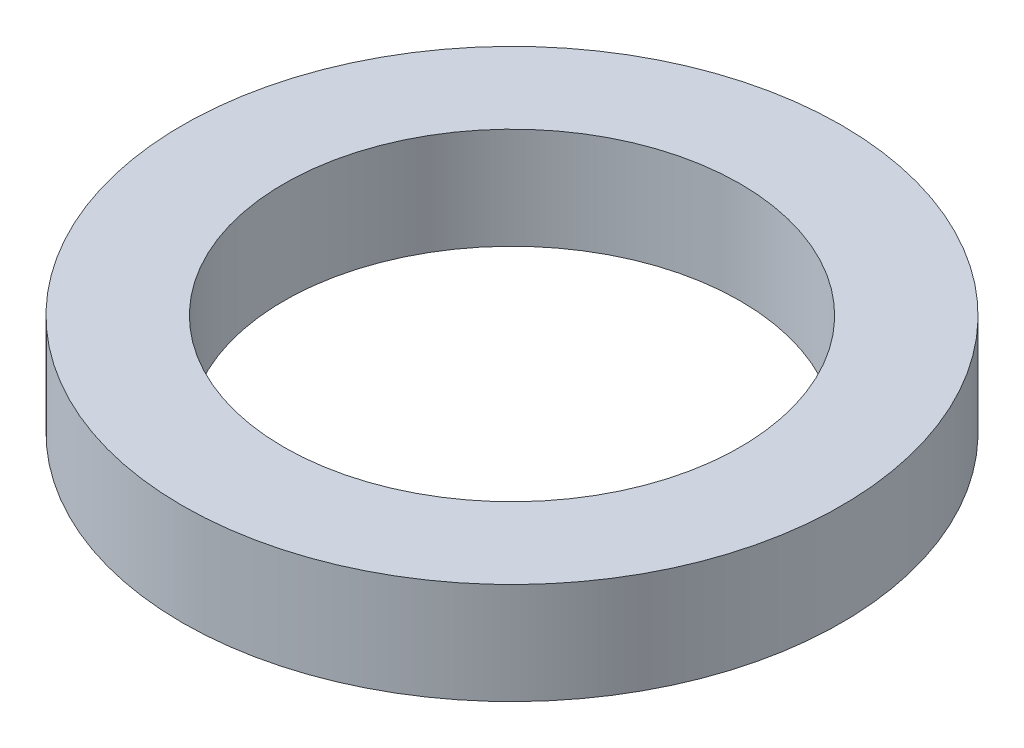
ISO-10303-21;
HEADER;
FILE_DESCRIPTION(('STEP AP214'),'2;1');
FILE_NAME('part.step','',(''),(''),'','','');
FILE_SCHEMA(('AUTOMOTIVE_DESIGN { 1 0 10303 214 1 1 1 1 }'));
ENDSEC;
DATA;
#1=APPLICATION_CONTEXT('core data for automotive mechanical design processes');
#2=APPLICATION_PROTOCOL_DEFINITION('international standard','automotive_design',2000,#1);
#3=PRODUCT_CONTEXT('',#1,'mechanical');
#4=PRODUCT('Part','Part','',(#3));
#5=PRODUCT_RELATED_PRODUCT_CATEGORY('part','',(#4));
#6=PRODUCT_DEFINITION_FORMATION('','',#4);
#7=PRODUCT_DEFINITION_CONTEXT('part definition',#1,'design');
#8=PRODUCT_DEFINITION('design','',#6,#7);
#9=PRODUCT_DEFINITION_SHAPE('','',#8);
#10=(LENGTH_UNIT() NAMED_UNIT(*) SI_UNIT(.MILLI.,.METRE.));
#11=(NAMED_UNIT(*) PLANE_ANGLE_UNIT() SI_UNIT($,.RADIAN.));
#12=(NAMED_UNIT(*) SI_UNIT($,.STERADIAN.) SOLID_ANGLE_UNIT());
#13=UNCERTAINTY_MEASURE_WITH_UNIT(LENGTH_MEASURE(1.E-05),#10,'distance_accuracy_value','');
#14=(GEOMETRIC_REPRESENTATION_CONTEXT(3) GLOBAL_UNCERTAINTY_ASSIGNED_CONTEXT((#13)) GLOBAL_UNIT_ASSIGNED_CONTEXT((#10,
#11,#12)) REPRESENTATION_CONTEXT('',''));
#15=CARTESIAN_POINT('',(0.,0.,0.));
#16=DIRECTION('',(0.,0.,1.));
#17=DIRECTION('',(1.,0.,0.));
#18=AXIS2_PLACEMENT_3D('',#15,#16,#17);
#19=CARTESIAN_POINT('',(0.,1.,0.));
#20=DIRECTION('',(0.,1.,0.));
#21=DIRECTION('',(0.,0.,1.));
#22=AXIS2_PLACEMENT_3D('',#19,#20,#21);
#23=PLANE('',#22);
#24=CARTESIAN_POINT('',(0.,1.,0.));
#25=DIRECTION('',(0.,1.,0.));
#26=DIRECTION('',(0.,0.,1.));
#27=AXIS2_PLACEMENT_3D('',#24,#25,#26);
#28=CIRCLE('',#27,3.25);
#29=CARTESIAN_POINT('',(0.,1.,3.25));
#30=VERTEX_POINT('',#29);
#31=EDGE_CURVE('E10',#30,#30,#28,.T.);
#32=ORIENTED_EDGE('',*,*,#31,.T.);
#33=EDGE_LOOP('',(#32));
#34=FACE_BOUND('',#33,.T.);
#35=CARTESIAN_POINT('',(0.,1.,0.));
#36=DIRECTION('',(0.,1.,0.));
#37=DIRECTION('',(0.,0.,1.));
#38=AXIS2_PLACEMENT_3D('',#35,#36,#37);
#39=CIRCLE('',#38,2.25);
#40=CARTESIAN_POINT('',(0.,1.,2.25));
#41=VERTEX_POINT('',#40);
#42=EDGE_CURVE('E42',#41,#41,#39,.T.);
#43=ORIENTED_EDGE('',*,*,#42,.F.);
#44=EDGE_LOOP('',(#43));
#45=FACE_BOUND('',#44,.T.);
#46=ADVANCED_FACE('F31',(#34,#45),#23,.T.);
#47=CARTESIAN_POINT('',(0.,0.,0.));
#48=DIRECTION('',(0.,1.,0.));
#49=DIRECTION('',(0.,0.,1.));
#50=AXIS2_PLACEMENT_3D('',#47,#48,#49);
#51=PLANE('',#50);
#52=CARTESIAN_POINT('',(0.,0.,0.));
#53=DIRECTION('',(0.,1.,0.));
#54=DIRECTION('',(0.,0.,1.));
#55=AXIS2_PLACEMENT_3D('',#52,#53,#54);
#56=CIRCLE('',#55,3.25);
#57=CARTESIAN_POINT('',(0.,0.,3.25));
#58=VERTEX_POINT('',#57);
#59=EDGE_CURVE('E35',#58,#58,#56,.T.);
#60=ORIENTED_EDGE('',*,*,#59,.F.);
#61=EDGE_LOOP('',(#60));
#62=FACE_BOUND('',#61,.T.);
#63=CARTESIAN_POINT('',(0.,0.,0.));
#64=DIRECTION('',(0.,1.,0.));
#65=DIRECTION('',(0.,0.,1.));
#66=AXIS2_PLACEMENT_3D('',#63,#64,#65);
#67=CIRCLE('',#66,2.25);
#68=CARTESIAN_POINT('',(0.,0.,2.25));
#69=VERTEX_POINT('',#68);
#70=EDGE_CURVE('E44',#69,#69,#67,.T.);
#71=ORIENTED_EDGE('',*,*,#70,.T.);
#72=EDGE_LOOP('',(#71));
#73=FACE_BOUND('',#72,.T.);
#74=ADVANCED_FACE('F54',(#62,#73),#51,.F.);
#75=CARTESIAN_POINT('',(0.,1.,0.));
#76=DIRECTION('',(0.,-1.,0.));
#77=DIRECTION('',(0.,0.,-1.));
#78=AXIS2_PLACEMENT_3D('',#75,#76,#77);
#79=CYLINDRICAL_SURFACE('',#78,3.25);
#80=ORIENTED_EDGE('',*,*,#31,.F.);
#81=EDGE_LOOP('',(#80));
#82=FACE_BOUND('',#81,.T.);
#83=ORIENTED_EDGE('',*,*,#59,.T.);
#84=EDGE_LOOP('',(#83));
#85=FACE_BOUND('',#84,.T.);
#86=ADVANCED_FACE('F33',(#82,#85),#79,.T.);
#87=CARTESIAN_POINT('',(0.,1.,0.));
#88=DIRECTION('',(0.,-1.,0.));
#89=DIRECTION('',(0.,0.,-1.));
#90=AXIS2_PLACEMENT_3D('',#87,#88,#89);
#91=CYLINDRICAL_SURFACE('',#90,2.25);
#92=ORIENTED_EDGE('',*,*,#42,.T.);
#93=EDGE_LOOP('',(#92));
#94=FACE_BOUND('',#93,.T.);
#95=ORIENTED_EDGE('',*,*,#70,.F.);
#96=EDGE_LOOP('',(#95));
#97=FACE_BOUND('',#96,.T.);
#98=ADVANCED_FACE('F50',(#94,#97),#91,.F.);
#99=CLOSED_SHELL('',(#46,#74,#86,#98));
#100=MANIFOLD_SOLID_BREP('B2',#99);
#101=ADVANCED_BREP_SHAPE_REPRESENTATION('',(#18,#100),#14);
#102=SHAPE_DEFINITION_REPRESENTATION(#9,#101);
ENDSEC;
END-ISO-10303-21;
